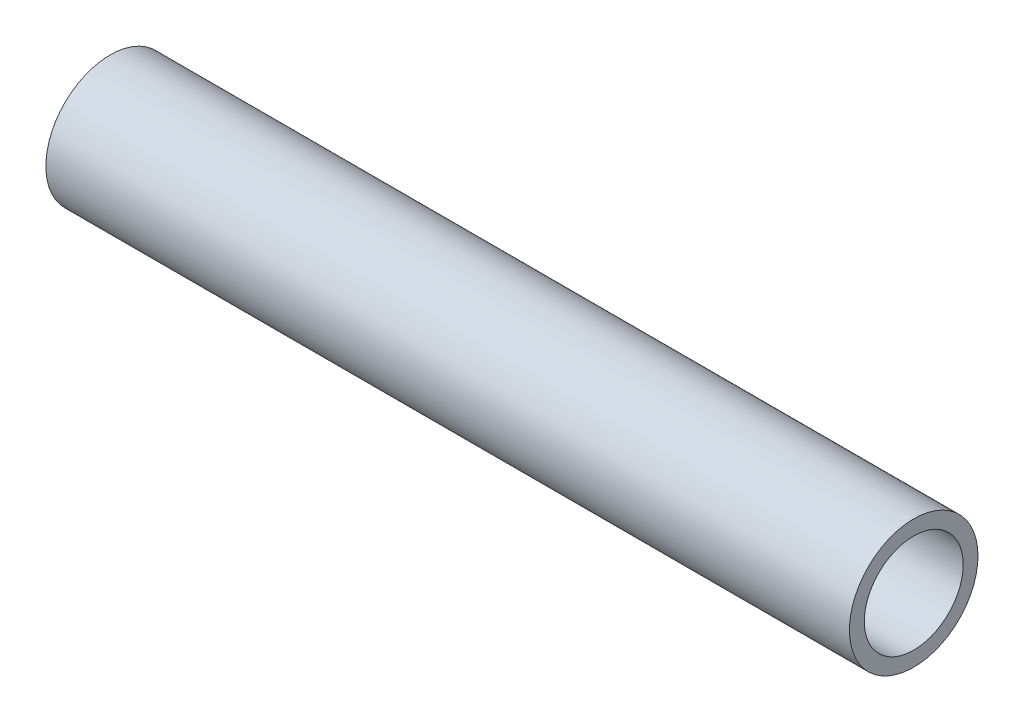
ISO-10303-21;
HEADER;
FILE_DESCRIPTION(('STEP AP214'),'2;1');
FILE_NAME('part.step','',(''),(''),'','','');
FILE_SCHEMA(('AUTOMOTIVE_DESIGN { 1 0 10303 214 1 1 1 1 }'));
ENDSEC;
DATA;
#1=APPLICATION_CONTEXT('core data for automotive mechanical design processes');
#2=APPLICATION_PROTOCOL_DEFINITION('international standard','automotive_design',2000,#1);
#3=PRODUCT_CONTEXT('',#1,'mechanical');
#4=PRODUCT('Part','Part','',(#3));
#5=PRODUCT_RELATED_PRODUCT_CATEGORY('part','',(#4));
#6=PRODUCT_DEFINITION_FORMATION('','',#4);
#7=PRODUCT_DEFINITION_CONTEXT('part definition',#1,'design');
#8=PRODUCT_DEFINITION('design','',#6,#7);
#9=PRODUCT_DEFINITION_SHAPE('','',#8);
#10=(LENGTH_UNIT() NAMED_UNIT(*) SI_UNIT(.MILLI.,.METRE.));
#11=(NAMED_UNIT(*) PLANE_ANGLE_UNIT() SI_UNIT($,.RADIAN.));
#12=(NAMED_UNIT(*) SI_UNIT($,.STERADIAN.) SOLID_ANGLE_UNIT());
#13=UNCERTAINTY_MEASURE_WITH_UNIT(LENGTH_MEASURE(1.E-05),#10,'distance_accuracy_value','');
#14=(GEOMETRIC_REPRESENTATION_CONTEXT(3) GLOBAL_UNCERTAINTY_ASSIGNED_CONTEXT((#13)) GLOBAL_UNIT_ASSIGNED_CONTEXT((#10,
#11,#12)) REPRESENTATION_CONTEXT('',''));
#15=CARTESIAN_POINT('',(0.,0.,0.));
#16=DIRECTION('',(0.,0.,1.));
#17=DIRECTION('',(1.,0.,0.));
#18=AXIS2_PLACEMENT_3D('',#15,#16,#17);
#19=CARTESIAN_POINT('',(206.375,0.,4.44089209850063E-13));
#20=DIRECTION('',(-1.,0.,0.));
#21=DIRECTION('',(0.,0.,1.));
#22=AXIS2_PLACEMENT_3D('',#19,#20,#21);
#23=CYLINDRICAL_SURFACE('',#22,12.7);
#24=CARTESIAN_POINT('',(206.375,0.,4.44089209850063E-13));
#25=DIRECTION('',(1.,0.,0.));
#26=DIRECTION('',(0.,0.,-1.));
#27=AXIS2_PLACEMENT_3D('',#24,#25,#26);
#28=CIRCLE('',#27,12.7);
#29=CARTESIAN_POINT('',(206.375,0.,-12.6999999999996));
#30=VERTEX_POINT('',#29);
#31=EDGE_CURVE('E40',#30,#30,#28,.T.);
#32=ORIENTED_EDGE('',*,*,#31,.T.);
#33=EDGE_LOOP('',(#32));
#34=FACE_BOUND('',#33,.T.);
#35=CARTESIAN_POINT('',(0.,0.,0.));
#36=DIRECTION('',(1.,0.,0.));
#37=DIRECTION('',(0.,0.,-1.));
#38=AXIS2_PLACEMENT_3D('',#35,#36,#37);
#39=CIRCLE('',#38,12.7);
#40=CARTESIAN_POINT('',(0.,0.,-12.7));
#41=VERTEX_POINT('',#40);
#42=EDGE_CURVE('E46',#41,#41,#39,.T.);
#43=ORIENTED_EDGE('',*,*,#42,.F.);
#44=EDGE_LOOP('',(#43));
#45=FACE_BOUND('',#44,.T.);
#46=ADVANCED_FACE('F33',(#34,#45),#23,.F.);
#47=CARTESIAN_POINT('',(206.375,0.,4.44089209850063E-13));
#48=DIRECTION('',(-1.,0.,0.));
#49=DIRECTION('',(0.,0.,1.));
#50=AXIS2_PLACEMENT_3D('',#47,#48,#49);
#51=CYLINDRICAL_SURFACE('',#50,16.51);
#52=CARTESIAN_POINT('',(206.375,0.,4.44089209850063E-13));
#53=DIRECTION('',(1.,0.,0.));
#54=DIRECTION('',(0.,0.,-1.));
#55=AXIS2_PLACEMENT_3D('',#52,#53,#54);
#56=CIRCLE('',#55,16.51);
#57=CARTESIAN_POINT('',(206.375,0.,-16.5099999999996));
#58=VERTEX_POINT('',#57);
#59=EDGE_CURVE('E10',#58,#58,#56,.T.);
#60=ORIENTED_EDGE('',*,*,#59,.F.);
#61=EDGE_LOOP('',(#60));
#62=FACE_BOUND('',#61,.T.);
#63=CARTESIAN_POINT('',(0.,0.,0.));
#64=DIRECTION('',(1.,0.,0.));
#65=DIRECTION('',(0.,0.,-1.));
#66=AXIS2_PLACEMENT_3D('',#63,#64,#65);
#67=CIRCLE('',#66,16.51);
#68=CARTESIAN_POINT('',(0.,0.,-16.51));
#69=VERTEX_POINT('',#68);
#70=EDGE_CURVE('E36',#69,#69,#67,.T.);
#71=ORIENTED_EDGE('',*,*,#70,.T.);
#72=EDGE_LOOP('',(#71));
#73=FACE_BOUND('',#72,.T.);
#74=ADVANCED_FACE('F53',(#62,#73),#51,.T.);
#75=CARTESIAN_POINT('',(206.375,0.,4.44089209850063E-13));
#76=DIRECTION('',(1.,0.,0.));
#77=DIRECTION('',(0.,0.,-1.));
#78=AXIS2_PLACEMENT_3D('',#75,#76,#77);
#79=PLANE('',#78);
#80=ORIENTED_EDGE('',*,*,#31,.F.);
#81=EDGE_LOOP('',(#80));
#82=FACE_BOUND('',#81,.T.);
#83=ORIENTED_EDGE('',*,*,#59,.T.);
#84=EDGE_LOOP('',(#83));
#85=FACE_BOUND('',#84,.T.);
#86=ADVANCED_FACE('F57',(#82,#85),#79,.T.);
#87=CARTESIAN_POINT('',(0.,0.,0.));
#88=DIRECTION('',(1.,0.,0.));
#89=DIRECTION('',(0.,0.,-1.));
#90=AXIS2_PLACEMENT_3D('',#87,#88,#89);
#91=PLANE('',#90);
#92=ORIENTED_EDGE('',*,*,#42,.T.);
#93=EDGE_LOOP('',(#92));
#94=FACE_BOUND('',#93,.T.);
#95=ORIENTED_EDGE('',*,*,#70,.F.);
#96=EDGE_LOOP('',(#95));
#97=FACE_BOUND('',#96,.T.);
#98=ADVANCED_FACE('F55',(#94,#97),#91,.F.);
#99=CLOSED_SHELL('',(#46,#74,#86,#98));
#100=MANIFOLD_SOLID_BREP('B2',#99);
#101=ADVANCED_BREP_SHAPE_REPRESENTATION('',(#18,#100),#14);
#102=SHAPE_DEFINITION_REPRESENTATION(#9,#101);
ENDSEC;
END-ISO-10303-21;
